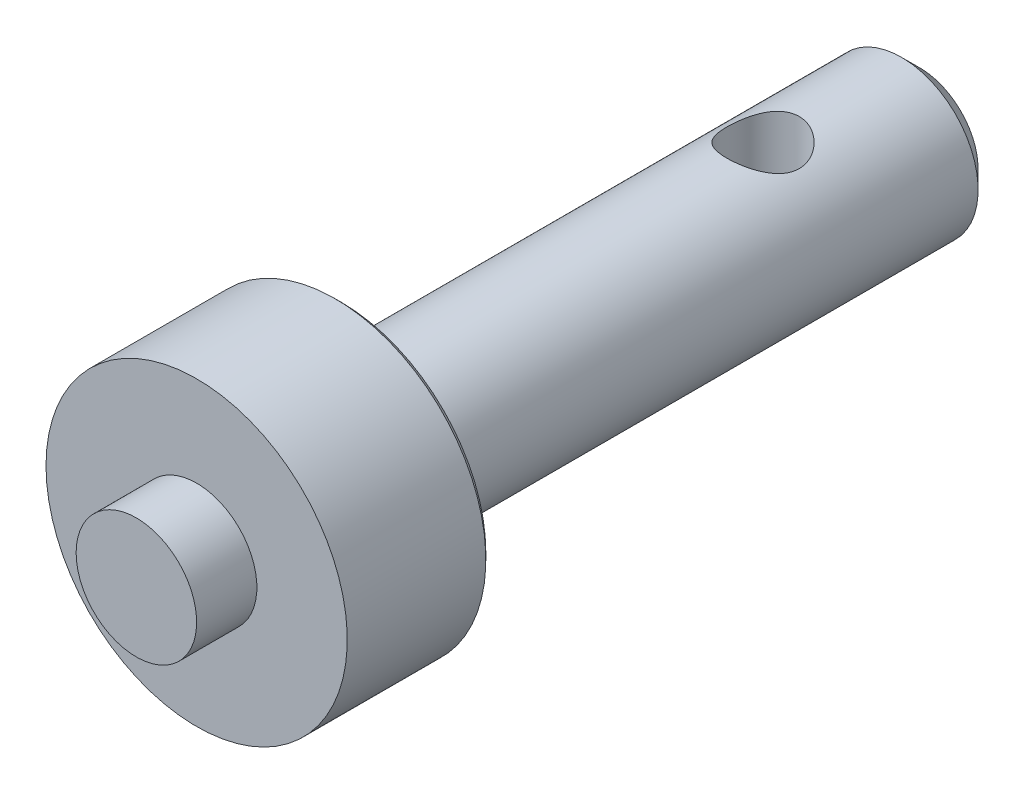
from build123d import *

# Parameters (mm, degrees)
SKETCH_2_R          = 3
CUT_EXTRUDE_1_DEPTH = 10


with BuildPart() as part:
    # Sketch 1 → Revolve 1 (revolve)
    with BuildSketch(Plane(origin=(0, 0, 0), x_dir=(0, 0, -1), z_dir=(1, 0, 0)), mode=Mode.PRIVATE) as revolve_1_sk:
        Polygon((0, 0), (0, 5), (5, 5), (5, 12.5), (16.5, 12.5), (17, 12), (17, 6.35), (63.5, 6.35), (65, 4.85), (65, 0), align=None)
    revolve(revolve_1_sk.sketch.rotate(Axis((0, 0, -65), (0, 0, 1)), 90), axis=Axis((0, 0, -65), (0, 0, 1)))

    # Sketch 2 → Cut-Extrude 1 (cut, symmetric)
    with BuildSketch(Plane(origin=(0, 0, 0), x_dir=(1, 0, 0), z_dir=(0, 1, 0))):
        with Locations(Location((0, 52, 0), (0, 0, 270))):
            Circle(SKETCH_2_R)
    extrude(amount=CUT_EXTRUDE_1_DEPTH, both=True, mode=Mode.SUBTRACT)


solid = part.part
